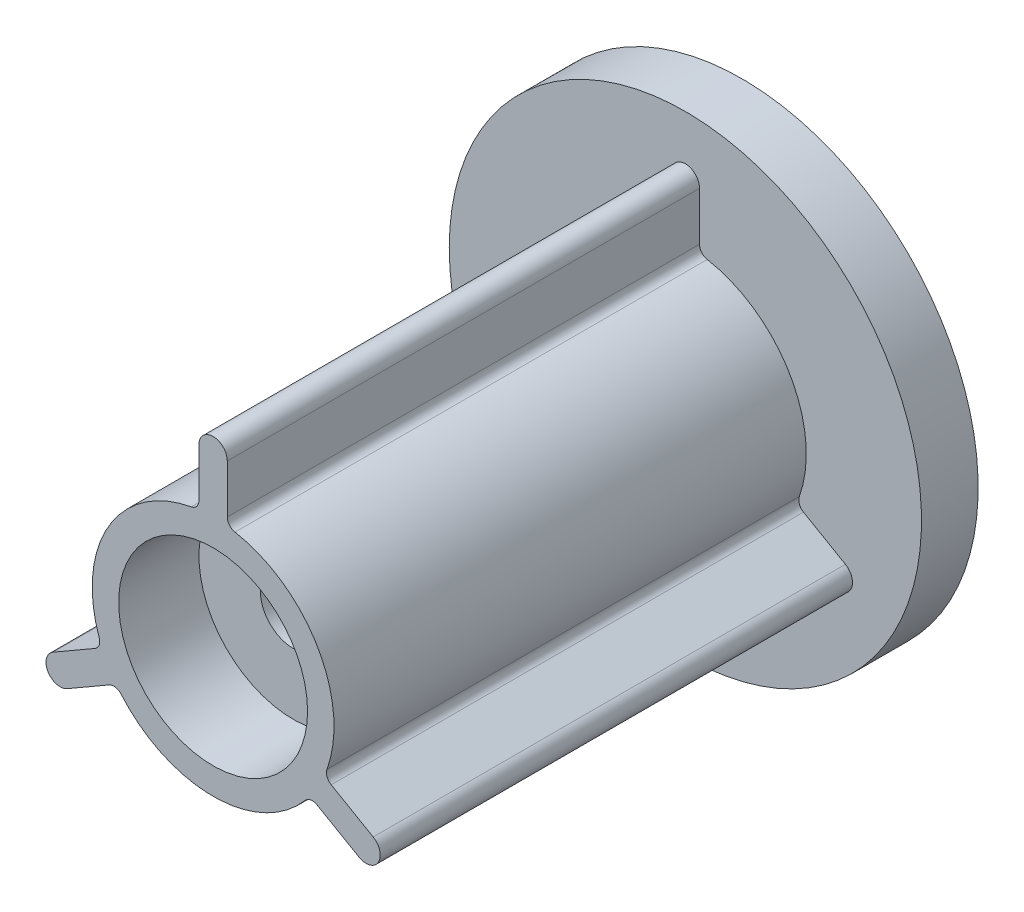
from build123d import *

# Parameters (mm, degrees)
BOSS_EXTRUDE1_DEPTH = 14
SKETCH2_R           = 12.5
BOSS_EXTRUDE2_DEPTH = 3
SKETCH3_R           = 1.75
CUT_EXTRUDE1_DEPTH  = 34.11344138
SKETCH4_R           = 5
CUT_EXTRUDE2_DEPTH  = 4.25
FILLET1_R           = 0.5


with BuildPart() as part:
    # Sketch1 → Boss-Extrude1 (new, symmetric)
    with BuildSketch(Plane.XY):
        with BuildLine():
            Line((-0.75, 9.35), (-0.75, 6.355902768))
            ThreePointArc((-0.75, 6.355902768), (-5.542562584, 3.2), (-5.879373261, -2.528432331))
            Line((-5.879373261, -2.528432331), (-8.472337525, -4.025480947))
            ThreePointArc((-8.472337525, -4.025480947), (-8.746856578, -5.05), (-7.722337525, -5.324519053))
            Line((-7.722337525, -5.324519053), (-5.129373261, -3.827470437))
            ThreePointArc((-5.129373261, -3.827470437), (0, -6.4), (5.129373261, -3.827470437))
            Line((5.129373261, -3.827470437), (7.722337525, -5.324519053))
            ThreePointArc((7.722337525, -5.324519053), (8.746856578, -5.05), (8.472337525, -4.025480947))
            Line((8.472337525, -4.025480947), (5.879373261, -2.528432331))
            ThreePointArc((5.879373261, -2.528432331), (5.542562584, 3.2), (0.75, 6.355902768))
            Line((0.75, 6.355902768), (0.75, 9.35))
            ThreePointArc((0.75, 9.35), (0, 10.1), (-0.75, 9.35))
        make_face()
    extrude(amount=BOSS_EXTRUDE1_DEPTH, both=True)

    # Sketch2 → Boss-Extrude2 (add)
    with BuildSketch(Plane(origin=(0, 0, -14), x_dir=(-1, 0, 0), z_dir=(0, 0, -1))):
        Circle(SKETCH2_R)
    extrude(amount=-BOSS_EXTRUDE2_DEPTH)

    # Sketch3 → Cut-Extrude1 (cut, through all)
    with BuildSketch(Plane.XY.offset(14)):
        Circle(SKETCH3_R)
    extrude(amount=-CUT_EXTRUDE1_DEPTH, mode=Mode.SUBTRACT)

    # Sketch4 → Cut-Extrude2 (cut)
    with BuildSketch(Plane.XY.offset(14)):
        Circle(SKETCH4_R)
    cut_extrude2 = extrude(amount=-CUT_EXTRUDE2_DEPTH, mode=Mode.SUBTRACT)

    # Mirror1: Cut-Extrude2 across plane
    add(cut_extrude2.mirror(Plane.XY), mode=Mode.SUBTRACT)

    # Fillet1
    fillet1_edges = [part.edges().sort_by_distance(p)[0] for p in [
        (0.75, 6.355902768, 1.5),
        (5.879373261, -2.528432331, 1.5),
        (5.129373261, -3.827470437, 1.5),
        (-5.129373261, -3.827470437, 1.5),
        (-5.879373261, -2.528432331, 1.5),
        (-0.75, 6.355902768, 1.5),
    ]]
    fillet(fillet1_edges, radius=FILLET1_R)


solid = part.part
